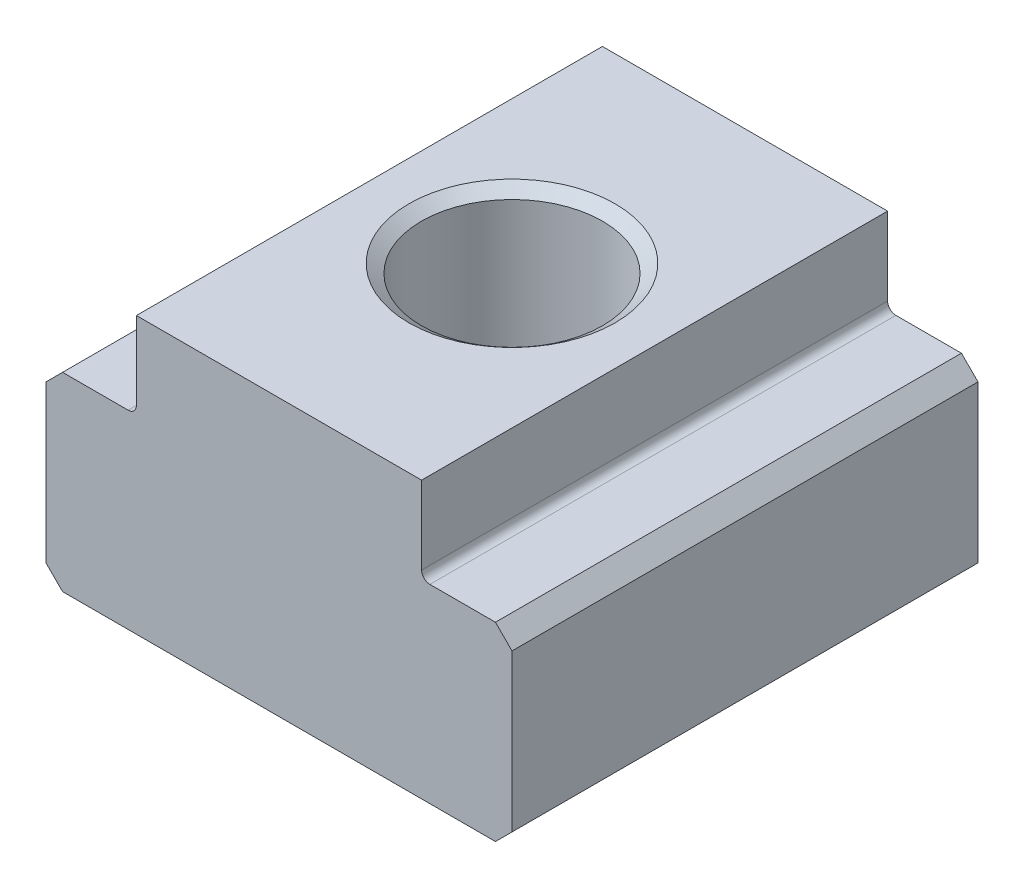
ISO-10303-21;
HEADER;
FILE_DESCRIPTION(('STEP AP214'),'2;1');
FILE_NAME('part.step','',(''),(''),'','','');
FILE_SCHEMA(('AUTOMOTIVE_DESIGN { 1 0 10303 214 1 1 1 1 }'));
ENDSEC;
DATA;
#1=APPLICATION_CONTEXT('core data for automotive mechanical design processes');
#2=APPLICATION_PROTOCOL_DEFINITION('international standard','automotive_design',2000,#1);
#3=PRODUCT_CONTEXT('',#1,'mechanical');
#4=PRODUCT('Part','Part','',(#3));
#5=PRODUCT_RELATED_PRODUCT_CATEGORY('part','',(#4));
#6=PRODUCT_DEFINITION_FORMATION('','',#4);
#7=PRODUCT_DEFINITION_CONTEXT('part definition',#1,'design');
#8=PRODUCT_DEFINITION('design','',#6,#7);
#9=PRODUCT_DEFINITION_SHAPE('','',#8);
#10=(LENGTH_UNIT() NAMED_UNIT(*) SI_UNIT(.MILLI.,.METRE.));
#11=(NAMED_UNIT(*) PLANE_ANGLE_UNIT() SI_UNIT($,.RADIAN.));
#12=(NAMED_UNIT(*) SI_UNIT($,.STERADIAN.) SOLID_ANGLE_UNIT());
#13=UNCERTAINTY_MEASURE_WITH_UNIT(LENGTH_MEASURE(1.E-05),#10,'distance_accuracy_value','');
#14=(GEOMETRIC_REPRESENTATION_CONTEXT(3) GLOBAL_UNCERTAINTY_ASSIGNED_CONTEXT((#13)) GLOBAL_UNIT_ASSIGNED_CONTEXT((#10,
#11,#12)) REPRESENTATION_CONTEXT('',''));
#15=CARTESIAN_POINT('',(0.,0.,0.));
#16=DIRECTION('',(0.,0.,1.));
#17=DIRECTION('',(1.,0.,0.));
#18=AXIS2_PLACEMENT_3D('',#15,#16,#17);
#19=CARTESIAN_POINT('',(0.,0.,-21.4376));
#20=DIRECTION('',(0.,1.,0.));
#21=DIRECTION('',(-1.,0.,0.));
#22=AXIS2_PLACEMENT_3D('',#19,#20,#21);
#23=CYLINDRICAL_SURFACE('',#22,8.33374);
#24=CARTESIAN_POINT('',(0.,0.859529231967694,-21.4376));
#25=DIRECTION('',(0.,-1.,0.));
#26=DIRECTION('',(0.,0.,-1.));
#27=AXIS2_PLACEMENT_3D('',#24,#25,#26);
#28=CIRCLE('',#27,8.33374);
#29=CARTESIAN_POINT('',(0.,0.859529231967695,-29.77134));
#30=VERTEX_POINT('',#29);
#31=EDGE_CURVE('E246',#30,#30,#28,.F.);
#32=ORIENTED_EDGE('',*,*,#31,.F.);
#33=EDGE_LOOP('',(#32));
#34=FACE_BOUND('',#33,.T.);
#35=CARTESIAN_POINT('',(0.,24.5912707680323,-21.4376));
#36=DIRECTION('',(0.,1.,0.));
#37=DIRECTION('',(0.,0.,1.));
#38=AXIS2_PLACEMENT_3D('',#35,#36,#37);
#39=CIRCLE('',#38,8.33374);
#40=CARTESIAN_POINT('',(0.,24.5912707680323,-13.10386));
#41=VERTEX_POINT('',#40);
#42=EDGE_CURVE('E263',#41,#41,#39,.F.);
#43=ORIENTED_EDGE('',*,*,#42,.F.);
#44=EDGE_LOOP('',(#43));
#45=FACE_BOUND('',#44,.T.);
#46=ADVANCED_FACE('F33',(#34,#45),#23,.F.);
#47=CARTESIAN_POINT('',(-13.1191,25.4,-42.8752));
#48=DIRECTION('',(0.,1.,0.));
#49=DIRECTION('',(-1.,0.,0.));
#50=AXIS2_PLACEMENT_3D('',#47,#48,#49);
#51=PLANE('',#50);
#52=DIRECTION('',(-1.,0.,0.));
#53=VECTOR('',#52,1.);
#54=CARTESIAN_POINT('',(-13.1191,25.4,0.));
#55=LINE('',#54,#53);
#56=CARTESIAN_POINT('',(13.1191,25.4,0.));
#57=VERTEX_POINT('',#56);
#58=CARTESIAN_POINT('',(-13.1191,25.4,0.));
#59=VERTEX_POINT('',#58);
#60=EDGE_CURVE('E195',#57,#59,#55,.T.);
#61=ORIENTED_EDGE('',*,*,#60,.F.);
#62=DIRECTION('',(0.,0.,1.));
#63=VECTOR('',#62,1.);
#64=CARTESIAN_POINT('',(13.1191,25.4,-42.8752));
#65=LINE('',#64,#63);
#66=CARTESIAN_POINT('',(13.1191,25.4,-42.8752));
#67=VERTEX_POINT('',#66);
#68=EDGE_CURVE('E215',#67,#57,#65,.T.);
#69=ORIENTED_EDGE('',*,*,#68,.F.);
#70=DIRECTION('',(-1.,0.,0.));
#71=VECTOR('',#70,1.);
#72=CARTESIAN_POINT('',(-13.1191,25.4,-42.8752));
#73=LINE('',#72,#71);
#74=CARTESIAN_POINT('',(-13.1191,25.4,-42.8752));
#75=VERTEX_POINT('',#74);
#76=EDGE_CURVE('E165',#67,#75,#73,.T.);
#77=ORIENTED_EDGE('',*,*,#76,.T.);
#78=DIRECTION('',(0.,0.,1.));
#79=VECTOR('',#78,1.);
#80=CARTESIAN_POINT('',(-13.1191,25.4,-42.8752));
#81=LINE('',#80,#79);
#82=EDGE_CURVE('E213',#75,#59,#81,.T.);
#83=ORIENTED_EDGE('',*,*,#82,.T.);
#84=EDGE_LOOP('',(#61,#69,#77,#83));
#85=FACE_BOUND('',#84,.T.);
#86=CARTESIAN_POINT('',(0.,25.4,-21.4376));
#87=DIRECTION('',(0.,1.,0.));
#88=DIRECTION('',(-1.,0.,0.));
#89=AXIS2_PLACEMENT_3D('',#86,#87,#88);
#90=CIRCLE('',#89,9.48872504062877);
#91=CARTESIAN_POINT('',(-9.48872504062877,25.4,-21.4376));
#92=VERTEX_POINT('',#91);
#93=EDGE_CURVE('E37',#92,#92,#90,.F.);
#94=ORIENTED_EDGE('',*,*,#93,.T.);
#95=EDGE_LOOP('',(#94));
#96=FACE_BOUND('',#95,.T.);
#97=ADVANCED_FACE('F310',(#85,#96),#51,.T.);
#98=CARTESIAN_POINT('',(-21.4376,0.,-42.8752));
#99=DIRECTION('',(0.,-1.,0.));
#100=DIRECTION('',(1.,0.,0.));
#101=AXIS2_PLACEMENT_3D('',#98,#99,#100);
#102=PLANE('',#101);
#103=DIRECTION('',(1.,0.,0.));
#104=VECTOR('',#103,1.);
#105=CARTESIAN_POINT('',(-21.4376,0.,-42.8752));
#106=LINE('',#105,#104);
#107=CARTESIAN_POINT('',(-19.9136,0.,-42.8752));
#108=VERTEX_POINT('',#107);
#109=CARTESIAN_POINT('',(19.9136,0.,-42.8752));
#110=VERTEX_POINT('',#109);
#111=EDGE_CURVE('E270',#108,#110,#106,.T.);
#112=ORIENTED_EDGE('',*,*,#111,.T.);
#113=DIRECTION('',(0.,0.,1.));
#114=VECTOR('',#113,1.);
#115=CARTESIAN_POINT('',(19.9136,0.,-42.8752));
#116=LINE('',#115,#114);
#117=CARTESIAN_POINT('',(19.9136,0.,0.));
#118=VERTEX_POINT('',#117);
#119=EDGE_CURVE('E239',#110,#118,#116,.T.);
#120=ORIENTED_EDGE('',*,*,#119,.T.);
#121=DIRECTION('',(1.,0.,0.));
#122=VECTOR('',#121,1.);
#123=CARTESIAN_POINT('',(-21.4376,0.,0.));
#124=LINE('',#123,#122);
#125=CARTESIAN_POINT('',(-19.9136,0.,0.));
#126=VERTEX_POINT('',#125);
#127=EDGE_CURVE('E182',#126,#118,#124,.T.);
#128=ORIENTED_EDGE('',*,*,#127,.F.);
#129=DIRECTION('',(0.,0.,-1.));
#130=VECTOR('',#129,1.);
#131=CARTESIAN_POINT('',(-19.9136,0.,-42.8752));
#132=LINE('',#131,#130);
#133=EDGE_CURVE('E57',#126,#108,#132,.T.);
#134=ORIENTED_EDGE('',*,*,#133,.T.);
#135=EDGE_LOOP('',(#112,#120,#128,#134));
#136=FACE_BOUND('',#135,.T.);
#137=CARTESIAN_POINT('',(0.,0.,-21.4376));
#138=DIRECTION('',(0.,-1.,0.));
#139=DIRECTION('',(1.,0.,0.));
#140=AXIS2_PLACEMENT_3D('',#137,#138,#139);
#141=CIRCLE('',#140,9.52500000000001);
#142=CARTESIAN_POINT('',(9.52500000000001,0.,-21.4376));
#143=VERTEX_POINT('',#142);
#144=EDGE_CURVE('E183',#143,#143,#141,.F.);
#145=ORIENTED_EDGE('',*,*,#144,.T.);
#146=EDGE_LOOP('',(#145));
#147=FACE_BOUND('',#146,.T.);
#148=ADVANCED_FACE('F252',(#136,#147),#102,.T.);
#149=CARTESIAN_POINT('',(-21.4376,0.,-42.8752));
#150=DIRECTION('',(-1.,0.,0.));
#151=DIRECTION('',(0.,-1.,0.));
#152=AXIS2_PLACEMENT_3D('',#149,#150,#151);
#153=PLANE('',#152);
#154=DIRECTION('',(0.,-1.,0.));
#155=VECTOR('',#154,1.);
#156=CARTESIAN_POINT('',(-21.4376,0.,-42.8752));
#157=LINE('',#156,#155);
#158=CARTESIAN_POINT('',(-21.4376,15.9512,-42.8752));
#159=VERTEX_POINT('',#158);
#160=CARTESIAN_POINT('',(-21.4376,1.52400000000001,-42.8752));
#161=VERTEX_POINT('',#160);
#162=EDGE_CURVE('E207',#159,#161,#157,.T.);
#163=ORIENTED_EDGE('',*,*,#162,.T.);
#164=DIRECTION('',(0.,0.,1.));
#165=VECTOR('',#164,1.);
#166=CARTESIAN_POINT('',(-21.4376,1.52400000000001,-42.8752));
#167=LINE('',#166,#165);
#168=CARTESIAN_POINT('',(-21.4376,1.52400000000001,0.));
#169=VERTEX_POINT('',#168);
#170=EDGE_CURVE('E42',#161,#169,#167,.T.);
#171=ORIENTED_EDGE('',*,*,#170,.T.);
#172=DIRECTION('',(0.,-1.,0.));
#173=VECTOR('',#172,1.);
#174=CARTESIAN_POINT('',(-21.4376,0.,0.));
#175=LINE('',#174,#173);
#176=CARTESIAN_POINT('',(-21.4376,15.9512,0.));
#177=VERTEX_POINT('',#176);
#178=EDGE_CURVE('E179',#177,#169,#175,.T.);
#179=ORIENTED_EDGE('',*,*,#178,.F.);
#180=DIRECTION('',(0.,0.,-1.));
#181=VECTOR('',#180,1.);
#182=CARTESIAN_POINT('',(-21.4376,15.9512,-42.8752));
#183=LINE('',#182,#181);
#184=EDGE_CURVE('E242',#177,#159,#183,.T.);
#185=ORIENTED_EDGE('',*,*,#184,.T.);
#186=EDGE_LOOP('',(#163,#171,#179,#185));
#187=FACE_BOUND('',#186,.T.);
#188=ADVANCED_FACE('F290',(#187),#153,.T.);
#189=CARTESIAN_POINT('',(-21.4376,17.4752,-42.8752));
#190=DIRECTION('',(0.,1.,0.));
#191=DIRECTION('',(0.,0.,1.));
#192=AXIS2_PLACEMENT_3D('',#189,#190,#191);
#193=PLANE('',#192);
#194=DIRECTION('',(-1.,0.,0.));
#195=VECTOR('',#194,1.);
#196=CARTESIAN_POINT('',(-21.4376,17.4752,-42.8752));
#197=LINE('',#196,#195);
#198=CARTESIAN_POINT('',(-13.8811,17.4752,-42.8752));
#199=VERTEX_POINT('',#198);
#200=CARTESIAN_POINT('',(-19.9136,17.4752,-42.8752));
#201=VERTEX_POINT('',#200);
#202=EDGE_CURVE('E157',#199,#201,#197,.T.);
#203=ORIENTED_EDGE('',*,*,#202,.T.);
#204=DIRECTION('',(0.,0.,1.));
#205=VECTOR('',#204,1.);
#206=CARTESIAN_POINT('',(-19.9136,17.4752,-42.8752));
#207=LINE('',#206,#205);
#208=CARTESIAN_POINT('',(-19.9136,17.4752,0.));
#209=VERTEX_POINT('',#208);
#210=EDGE_CURVE('E11',#201,#209,#207,.T.);
#211=ORIENTED_EDGE('',*,*,#210,.T.);
#212=DIRECTION('',(-1.,0.,0.));
#213=VECTOR('',#212,1.);
#214=CARTESIAN_POINT('',(-21.4376,17.4752,0.));
#215=LINE('',#214,#213);
#216=CARTESIAN_POINT('',(-13.8811,17.4752,0.));
#217=VERTEX_POINT('',#216);
#218=EDGE_CURVE('E204',#217,#209,#215,.T.);
#219=ORIENTED_EDGE('',*,*,#218,.F.);
#220=DIRECTION('',(0.,0.,1.));
#221=VECTOR('',#220,1.);
#222=CARTESIAN_POINT('',(-13.8811,17.4752,-42.8752));
#223=LINE('',#222,#221);
#224=EDGE_CURVE('E208',#199,#217,#223,.T.);
#225=ORIENTED_EDGE('',*,*,#224,.F.);
#226=EDGE_LOOP('',(#203,#211,#219,#225));
#227=FACE_BOUND('',#226,.T.);
#228=ADVANCED_FACE('F299',(#227),#193,.T.);
#229=CARTESIAN_POINT('',(-13.8811,18.2372,-42.8752));
#230=DIRECTION('',(0.,0.,1.));
#231=DIRECTION('',(1.,0.,0.));
#232=AXIS2_PLACEMENT_3D('',#229,#230,#231);
#233=CYLINDRICAL_SURFACE('',#232,0.762000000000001);
#234=CARTESIAN_POINT('',(-13.8811,18.2372,0.));
#235=DIRECTION('',(0.,0.,-1.));
#236=DIRECTION('',(-1.,0.,0.));
#237=AXIS2_PLACEMENT_3D('',#234,#235,#236);
#238=CIRCLE('',#237,0.762000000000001);
#239=CARTESIAN_POINT('',(-13.1191,18.2372,0.));
#240=VERTEX_POINT('',#239);
#241=EDGE_CURVE('E201',#240,#217,#238,.T.);
#242=ORIENTED_EDGE('',*,*,#241,.F.);
#243=DIRECTION('',(0.,0.,1.));
#244=VECTOR('',#243,1.);
#245=CARTESIAN_POINT('',(-13.1191,18.2372,-42.8752));
#246=LINE('',#245,#244);
#247=CARTESIAN_POINT('',(-13.1191,18.2372,-42.8752));
#248=VERTEX_POINT('',#247);
#249=EDGE_CURVE('E211',#248,#240,#246,.T.);
#250=ORIENTED_EDGE('',*,*,#249,.F.);
#251=CARTESIAN_POINT('',(-13.8811,18.2372,-42.8752));
#252=DIRECTION('',(0.,0.,-1.));
#253=DIRECTION('',(-1.,0.,0.));
#254=AXIS2_PLACEMENT_3D('',#251,#252,#253);
#255=CIRCLE('',#254,0.762000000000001);
#256=EDGE_CURVE('E174',#248,#199,#255,.T.);
#257=ORIENTED_EDGE('',*,*,#256,.T.);
#258=ORIENTED_EDGE('',*,*,#224,.T.);
#259=EDGE_LOOP('',(#242,#250,#257,#258));
#260=FACE_BOUND('',#259,.T.);
#261=ADVANCED_FACE('F303',(#260),#233,.F.);
#262=CARTESIAN_POINT('',(-13.1191,18.2372,-42.8752));
#263=DIRECTION('',(-1.,0.,0.));
#264=DIRECTION('',(0.,-1.,0.));
#265=AXIS2_PLACEMENT_3D('',#262,#263,#264);
#266=PLANE('',#265);
#267=DIRECTION('',(0.,-1.,0.));
#268=VECTOR('',#267,1.);
#269=CARTESIAN_POINT('',(-13.1191,18.2372,0.));
#270=LINE('',#269,#268);
#271=EDGE_CURVE('E198',#59,#240,#270,.T.);
#272=ORIENTED_EDGE('',*,*,#271,.F.);
#273=ORIENTED_EDGE('',*,*,#82,.F.);
#274=DIRECTION('',(0.,-1.,0.));
#275=VECTOR('',#274,1.);
#276=CARTESIAN_POINT('',(-13.1191,18.2372,-42.8752));
#277=LINE('',#276,#275);
#278=EDGE_CURVE('E171',#75,#248,#277,.T.);
#279=ORIENTED_EDGE('',*,*,#278,.T.);
#280=ORIENTED_EDGE('',*,*,#249,.T.);
#281=EDGE_LOOP('',(#272,#273,#279,#280));
#282=FACE_BOUND('',#281,.T.);
#283=ADVANCED_FACE('F307',(#282),#266,.T.);
#284=CARTESIAN_POINT('',(13.1191,18.2372,-42.8752));
#285=DIRECTION('',(1.,0.,0.));
#286=DIRECTION('',(0.,1.,0.));
#287=AXIS2_PLACEMENT_3D('',#284,#285,#286);
#288=PLANE('',#287);
#289=DIRECTION('',(0.,1.,0.));
#290=VECTOR('',#289,1.);
#291=CARTESIAN_POINT('',(13.1191,18.2372,0.));
#292=LINE('',#291,#290);
#293=CARTESIAN_POINT('',(13.1191,18.2372,0.));
#294=VERTEX_POINT('',#293);
#295=EDGE_CURVE('E192',#294,#57,#292,.T.);
#296=ORIENTED_EDGE('',*,*,#295,.F.);
#297=DIRECTION('',(0.,0.,1.));
#298=VECTOR('',#297,1.);
#299=CARTESIAN_POINT('',(13.1191,18.2372,-42.8752));
#300=LINE('',#299,#298);
#301=CARTESIAN_POINT('',(13.1191,18.2372,-42.8752));
#302=VERTEX_POINT('',#301);
#303=EDGE_CURVE('E156',#302,#294,#300,.T.);
#304=ORIENTED_EDGE('',*,*,#303,.F.);
#305=DIRECTION('',(0.,1.,0.));
#306=VECTOR('',#305,1.);
#307=CARTESIAN_POINT('',(13.1191,18.2372,-42.8752));
#308=LINE('',#307,#306);
#309=EDGE_CURVE('E163',#302,#67,#308,.T.);
#310=ORIENTED_EDGE('',*,*,#309,.T.);
#311=ORIENTED_EDGE('',*,*,#68,.T.);
#312=EDGE_LOOP('',(#296,#304,#310,#311));
#313=FACE_BOUND('',#312,.T.);
#314=ADVANCED_FACE('F314',(#313),#288,.T.);
#315=CARTESIAN_POINT('',(13.8811,18.2372,-42.8752));
#316=DIRECTION('',(0.,0.,1.));
#317=DIRECTION('',(1.,0.,0.));
#318=AXIS2_PLACEMENT_3D('',#315,#316,#317);
#319=CYLINDRICAL_SURFACE('',#318,0.762000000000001);
#320=CARTESIAN_POINT('',(13.8811,18.2372,0.));
#321=DIRECTION('',(0.,0.,-1.));
#322=DIRECTION('',(1.,0.,0.));
#323=AXIS2_PLACEMENT_3D('',#320,#321,#322);
#324=CIRCLE('',#323,0.762000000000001);
#325=CARTESIAN_POINT('',(13.8811,17.4752,0.));
#326=VERTEX_POINT('',#325);
#327=EDGE_CURVE('E155',#326,#294,#324,.T.);
#328=ORIENTED_EDGE('',*,*,#327,.F.);
#329=DIRECTION('',(0.,0.,1.));
#330=VECTOR('',#329,1.);
#331=CARTESIAN_POINT('',(13.8811,17.4752,-42.8752));
#332=LINE('',#331,#330);
#333=CARTESIAN_POINT('',(13.8811,17.4752,-42.8752));
#334=VERTEX_POINT('',#333);
#335=EDGE_CURVE('E142',#334,#326,#332,.T.);
#336=ORIENTED_EDGE('',*,*,#335,.F.);
#337=CARTESIAN_POINT('',(13.8811,18.2372,-42.8752));
#338=DIRECTION('',(0.,0.,-1.));
#339=DIRECTION('',(1.,0.,0.));
#340=AXIS2_PLACEMENT_3D('',#337,#338,#339);
#341=CIRCLE('',#340,0.762000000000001);
#342=EDGE_CURVE('E148',#334,#302,#341,.T.);
#343=ORIENTED_EDGE('',*,*,#342,.T.);
#344=ORIENTED_EDGE('',*,*,#303,.T.);
#345=EDGE_LOOP('',(#328,#336,#343,#344));
#346=FACE_BOUND('',#345,.T.);
#347=ADVANCED_FACE('F153',(#346),#319,.F.);
#348=CARTESIAN_POINT('',(13.8811,17.4752,-42.8752));
#349=DIRECTION('',(0.,1.,0.));
#350=DIRECTION('',(-1.,0.,0.));
#351=AXIS2_PLACEMENT_3D('',#348,#349,#350);
#352=PLANE('',#351);
#353=DIRECTION('',(-1.,0.,0.));
#354=VECTOR('',#353,1.);
#355=CARTESIAN_POINT('',(13.8811,17.4752,0.));
#356=LINE('',#355,#354);
#357=CARTESIAN_POINT('',(19.9136,17.4752,0.));
#358=VERTEX_POINT('',#357);
#359=EDGE_CURVE('E189',#358,#326,#356,.T.);
#360=ORIENTED_EDGE('',*,*,#359,.F.);
#361=DIRECTION('',(0.,0.,-1.));
#362=VECTOR('',#361,1.);
#363=CARTESIAN_POINT('',(19.9136,17.4752,-42.8752));
#364=LINE('',#363,#362);
#365=CARTESIAN_POINT('',(19.9136,17.4752,-42.8752));
#366=VERTEX_POINT('',#365);
#367=EDGE_CURVE('E145',#358,#366,#364,.T.);
#368=ORIENTED_EDGE('',*,*,#367,.T.);
#369=DIRECTION('',(-1.,0.,0.));
#370=VECTOR('',#369,1.);
#371=CARTESIAN_POINT('',(13.8811,17.4752,-42.8752));
#372=LINE('',#371,#370);
#373=EDGE_CURVE('E138',#366,#334,#372,.T.);
#374=ORIENTED_EDGE('',*,*,#373,.T.);
#375=ORIENTED_EDGE('',*,*,#335,.T.);
#376=EDGE_LOOP('',(#360,#368,#374,#375));
#377=FACE_BOUND('',#376,.T.);
#378=ADVANCED_FACE('F141',(#377),#352,.T.);
#379=CARTESIAN_POINT('',(21.4376,0.,-42.8752));
#380=DIRECTION('',(1.,0.,0.));
#381=DIRECTION('',(0.,1.,0.));
#382=AXIS2_PLACEMENT_3D('',#379,#380,#381);
#383=PLANE('',#382);
#384=DIRECTION('',(0.,1.,0.));
#385=VECTOR('',#384,1.);
#386=CARTESIAN_POINT('',(21.4376,0.,-42.8752));
#387=LINE('',#386,#385);
#388=CARTESIAN_POINT('',(21.4376,1.52400000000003,-42.8752));
#389=VERTEX_POINT('',#388);
#390=CARTESIAN_POINT('',(21.4376,15.9512,-42.8752));
#391=VERTEX_POINT('',#390);
#392=EDGE_CURVE('E149',#389,#391,#387,.T.);
#393=ORIENTED_EDGE('',*,*,#392,.T.);
#394=DIRECTION('',(0.,0.,1.));
#395=VECTOR('',#394,1.);
#396=CARTESIAN_POINT('',(21.4376,15.9512,-42.8752));
#397=LINE('',#396,#395);
#398=CARTESIAN_POINT('',(21.4376,15.9512,0.));
#399=VERTEX_POINT('',#398);
#400=EDGE_CURVE('E219',#391,#399,#397,.T.);
#401=ORIENTED_EDGE('',*,*,#400,.T.);
#402=DIRECTION('',(0.,1.,0.));
#403=VECTOR('',#402,1.);
#404=CARTESIAN_POINT('',(21.4376,0.,0.));
#405=LINE('',#404,#403);
#406=CARTESIAN_POINT('',(21.4376,1.52400000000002,0.));
#407=VERTEX_POINT('',#406);
#408=EDGE_CURVE('E186',#407,#399,#405,.T.);
#409=ORIENTED_EDGE('',*,*,#408,.F.);
#410=DIRECTION('',(0.,0.,-1.));
#411=VECTOR('',#410,1.);
#412=CARTESIAN_POINT('',(21.4376,1.52400000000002,-42.8752));
#413=LINE('',#412,#411);
#414=EDGE_CURVE('E210',#407,#389,#413,.T.);
#415=ORIENTED_EDGE('',*,*,#414,.T.);
#416=EDGE_LOOP('',(#393,#401,#409,#415));
#417=FACE_BOUND('',#416,.T.);
#418=ADVANCED_FACE('F274',(#417),#383,.T.);
#419=CARTESIAN_POINT('',(-13.8811,18.2372,-42.8752));
#420=DIRECTION('',(0.,0.,-1.));
#421=DIRECTION('',(-1.,0.,0.));
#422=AXIS2_PLACEMENT_3D('',#419,#420,#421);
#423=PLANE('',#422);
#424=ORIENTED_EDGE('',*,*,#373,.F.);
#425=DIRECTION('',(-0.707106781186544,0.707106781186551,0.));
#426=VECTOR('',#425,1.);
#427=CARTESIAN_POINT('',(2.63525000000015,34.75355,-42.8752));
#428=LINE('',#427,#426);
#429=EDGE_CURVE('E236',#366,#391,#428,.F.);
#430=ORIENTED_EDGE('',*,*,#429,.T.);
#431=ORIENTED_EDGE('',*,*,#392,.F.);
#432=DIRECTION('',(0.70710678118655,0.707106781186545,0.));
#433=VECTOR('',#432,1.);
#434=CARTESIAN_POINT('',(12.1348499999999,-7.77875000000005,-42.8752));
#435=LINE('',#434,#433);
#436=EDGE_CURVE('E50',#389,#110,#435,.F.);
#437=ORIENTED_EDGE('',*,*,#436,.T.);
#438=ORIENTED_EDGE('',*,*,#111,.F.);
#439=DIRECTION('',(0.707106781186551,-0.707106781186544,0.));
#440=VECTOR('',#439,1.);
#441=CARTESIAN_POINT('',(-26.01595,6.10234999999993,-42.8752));
#442=LINE('',#441,#440);
#443=EDGE_CURVE('E233',#108,#161,#442,.F.);
#444=ORIENTED_EDGE('',*,*,#443,.T.);
#445=ORIENTED_EDGE('',*,*,#162,.F.);
#446=DIRECTION('',(-0.707106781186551,-0.707106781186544,0.));
#447=VECTOR('',#446,1.);
#448=CARTESIAN_POINT('',(-16.51635,20.87245,-42.8752));
#449=LINE('',#448,#447);
#450=EDGE_CURVE('E231',#159,#201,#449,.F.);
#451=ORIENTED_EDGE('',*,*,#450,.T.);
#452=ORIENTED_EDGE('',*,*,#202,.F.);
#453=ORIENTED_EDGE('',*,*,#256,.F.);
#454=ORIENTED_EDGE('',*,*,#278,.F.);
#455=ORIENTED_EDGE('',*,*,#76,.F.);
#456=ORIENTED_EDGE('',*,*,#309,.F.);
#457=ORIENTED_EDGE('',*,*,#342,.F.);
#458=EDGE_LOOP('',(#424,#430,#431,#437,#438,#444,#445,#451,#452,#453,#454,#455,#456,#457));
#459=FACE_BOUND('',#458,.T.);
#460=ADVANCED_FACE('F160',(#459),#423,.T.);
#461=CARTESIAN_POINT('',(-13.8811,18.2372,0.));
#462=DIRECTION('',(0.,0.,-1.));
#463=DIRECTION('',(-1.,0.,0.));
#464=AXIS2_PLACEMENT_3D('',#461,#462,#463);
#465=PLANE('',#464);
#466=ORIENTED_EDGE('',*,*,#408,.T.);
#467=DIRECTION('',(0.707106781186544,-0.707106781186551,0.));
#468=VECTOR('',#467,1.);
#469=CARTESIAN_POINT('',(21.4376,15.9512,0.));
#470=LINE('',#469,#468);
#471=EDGE_CURVE('E228',#399,#358,#470,.F.);
#472=ORIENTED_EDGE('',*,*,#471,.T.);
#473=ORIENTED_EDGE('',*,*,#359,.T.);
#474=ORIENTED_EDGE('',*,*,#327,.T.);
#475=ORIENTED_EDGE('',*,*,#295,.T.);
#476=ORIENTED_EDGE('',*,*,#60,.T.);
#477=ORIENTED_EDGE('',*,*,#271,.T.);
#478=ORIENTED_EDGE('',*,*,#241,.T.);
#479=ORIENTED_EDGE('',*,*,#218,.T.);
#480=DIRECTION('',(0.707106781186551,0.707106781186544,0.));
#481=VECTOR('',#480,1.);
#482=CARTESIAN_POINT('',(-19.9136,17.4752,0.));
#483=LINE('',#482,#481);
#484=EDGE_CURVE('E222',#209,#177,#483,.F.);
#485=ORIENTED_EDGE('',*,*,#484,.T.);
#486=ORIENTED_EDGE('',*,*,#178,.T.);
#487=DIRECTION('',(-0.707106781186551,0.707106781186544,0.));
#488=VECTOR('',#487,1.);
#489=CARTESIAN_POINT('',(-21.4376,1.52400000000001,0.));
#490=LINE('',#489,#488);
#491=EDGE_CURVE('E224',#169,#126,#490,.F.);
#492=ORIENTED_EDGE('',*,*,#491,.T.);
#493=ORIENTED_EDGE('',*,*,#127,.T.);
#494=DIRECTION('',(-0.70710678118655,-0.707106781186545,0.));
#495=VECTOR('',#494,1.);
#496=CARTESIAN_POINT('',(19.9136,0.,0.));
#497=LINE('',#496,#495);
#498=EDGE_CURVE('E226',#118,#407,#497,.F.);
#499=ORIENTED_EDGE('',*,*,#498,.T.);
#500=EDGE_LOOP('',(#466,#472,#473,#474,#475,#476,#477,#478,#479,#485,#486,#492,#493,#499));
#501=FACE_BOUND('',#500,.T.);
#502=ADVANCED_FACE('F280',(#501),#465,.F.);
#503=CARTESIAN_POINT('',(21.4376,15.9512,-42.8752));
#504=DIRECTION('',(-0.707106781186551,-0.707106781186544,0.));
#505=DIRECTION('',(0.707106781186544,-0.707106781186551,0.));
#506=AXIS2_PLACEMENT_3D('',#503,#504,#505);
#507=PLANE('',#506);
#508=ORIENTED_EDGE('',*,*,#429,.F.);
#509=ORIENTED_EDGE('',*,*,#367,.F.);
#510=ORIENTED_EDGE('',*,*,#471,.F.);
#511=ORIENTED_EDGE('',*,*,#400,.F.);
#512=EDGE_LOOP('',(#508,#509,#510,#511));
#513=FACE_BOUND('',#512,.T.);
#514=ADVANCED_FACE('F278',(#513),#507,.F.);
#515=CARTESIAN_POINT('',(19.9136,0.,-42.8752));
#516=DIRECTION('',(-0.707106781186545,0.70710678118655,0.));
#517=DIRECTION('',(-0.70710678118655,-0.707106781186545,0.));
#518=AXIS2_PLACEMENT_3D('',#515,#516,#517);
#519=PLANE('',#518);
#520=ORIENTED_EDGE('',*,*,#436,.F.);
#521=ORIENTED_EDGE('',*,*,#414,.F.);
#522=ORIENTED_EDGE('',*,*,#498,.F.);
#523=ORIENTED_EDGE('',*,*,#119,.F.);
#524=EDGE_LOOP('',(#520,#521,#522,#523));
#525=FACE_BOUND('',#524,.T.);
#526=ADVANCED_FACE('F282',(#525),#519,.F.);
#527=CARTESIAN_POINT('',(-21.4376,1.52400000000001,-42.8752));
#528=DIRECTION('',(0.707106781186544,0.707106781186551,0.));
#529=DIRECTION('',(-0.707106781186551,0.707106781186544,0.));
#530=AXIS2_PLACEMENT_3D('',#527,#528,#529);
#531=PLANE('',#530);
#532=ORIENTED_EDGE('',*,*,#443,.F.);
#533=ORIENTED_EDGE('',*,*,#133,.F.);
#534=ORIENTED_EDGE('',*,*,#491,.F.);
#535=ORIENTED_EDGE('',*,*,#170,.F.);
#536=EDGE_LOOP('',(#532,#533,#534,#535));
#537=FACE_BOUND('',#536,.T.);
#538=ADVANCED_FACE('F288',(#537),#531,.F.);
#539=CARTESIAN_POINT('',(-19.9136,17.4752,-42.8752));
#540=DIRECTION('',(0.707106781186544,-0.707106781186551,0.));
#541=DIRECTION('',(0.707106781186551,0.707106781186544,0.));
#542=AXIS2_PLACEMENT_3D('',#539,#540,#541);
#543=PLANE('',#542);
#544=ORIENTED_EDGE('',*,*,#450,.F.);
#545=ORIENTED_EDGE('',*,*,#184,.F.);
#546=ORIENTED_EDGE('',*,*,#484,.F.);
#547=ORIENTED_EDGE('',*,*,#210,.F.);
#548=EDGE_LOOP('',(#544,#545,#546,#547));
#549=FACE_BOUND('',#548,.T.);
#550=ADVANCED_FACE('F35',(#549),#543,.F.);
#551=CARTESIAN_POINT('',(0.,0.0254000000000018,-21.4376));
#552=DIRECTION('',(0.,-1.,0.));
#553=DIRECTION('',(0.,0.,-1.));
#554=AXIS2_PLACEMENT_3D('',#551,#552,#553);
#555=CONICAL_SURFACE('',#554,9.52500000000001,0.959931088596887);
#556=CARTESIAN_POINT('',(0.,0.0254000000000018,-21.4376));
#557=DIRECTION('',(0.,1.,0.));
#558=DIRECTION('',(0.,0.,1.));
#559=AXIS2_PLACEMENT_3D('',#556,#557,#558);
#560=CIRCLE('',#559,9.52500000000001);
#561=CARTESIAN_POINT('',(0.,0.0254000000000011,-11.9126));
#562=VERTEX_POINT('',#561);
#563=EDGE_CURVE('E248',#562,#562,#560,.T.);
#564=ORIENTED_EDGE('',*,*,#563,.F.);
#565=EDGE_LOOP('',(#564));
#566=FACE_BOUND('',#565,.T.);
#567=ORIENTED_EDGE('',*,*,#31,.T.);
#568=EDGE_LOOP('',(#567));
#569=FACE_BOUND('',#568,.T.);
#570=ADVANCED_FACE('F258',(#566,#569),#555,.F.);
#571=CARTESIAN_POINT('',(0.,44.45,-21.4376));
#572=DIRECTION('',(0.,1.,0.));
#573=DIRECTION('',(0.,0.,1.));
#574=AXIS2_PLACEMENT_3D('',#571,#572,#573);
#575=CYLINDRICAL_SURFACE('',#574,9.52500000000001);
#576=ORIENTED_EDGE('',*,*,#144,.F.);
#577=EDGE_LOOP('',(#576));
#578=FACE_BOUND('',#577,.T.);
#579=ORIENTED_EDGE('',*,*,#563,.T.);
#580=EDGE_LOOP('',(#579));
#581=FACE_BOUND('',#580,.T.);
#582=ADVANCED_FACE('F254',(#578,#581),#575,.F.);
#583=CARTESIAN_POINT('',(0.,24.5078578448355,-21.4376));
#584=DIRECTION('',(0.,1.,0.));
#585=DIRECTION('',(0.,0.,1.));
#586=AXIS2_PLACEMENT_3D('',#583,#584,#585);
#587=CONICAL_SURFACE('',#586,8.21461400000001,0.959931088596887);
#588=ORIENTED_EDGE('',*,*,#93,.F.);
#589=EDGE_LOOP('',(#588));
#590=FACE_BOUND('',#589,.T.);
#591=ORIENTED_EDGE('',*,*,#42,.T.);
#592=EDGE_LOOP('',(#591));
#593=FACE_BOUND('',#592,.T.);
#594=ADVANCED_FACE('F257',(#590,#593),#587,.F.);
#595=CLOSED_SHELL('',(#46,#97,#148,#188,#228,#261,#283,#314,#347,#378,#418,#460,#502,#514,#526,
#538,#550,#570,#582,#594));
#596=MANIFOLD_SOLID_BREP('B2',#595);
#597=ADVANCED_BREP_SHAPE_REPRESENTATION('',(#18,#596),#14);
#598=SHAPE_DEFINITION_REPRESENTATION(#9,#597);
ENDSEC;
END-ISO-10303-21;
